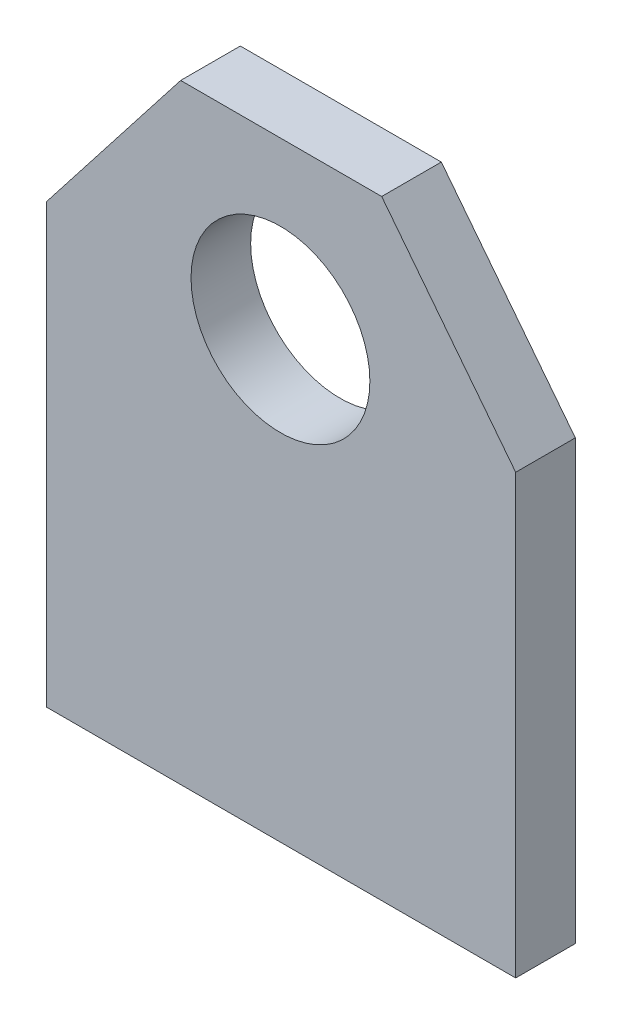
from build123d import *

# Parameters (mm, degrees)
LINEAR_AUSTRAGEN1_DEPTH = 8.382
SKIZZE2_R               = 12.570510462
LINEAR_AUSTRAGEN2_DEPTH = 109.468847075


with BuildPart() as part:
    # Skizze1 → Linear austragen1 (new body)
    with BuildSketch(Plane.XY):
        Polygon((0, 0), (-65.929053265, 0), (-65.929053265, 61.567334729), (-47.092023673, 85.723933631), (-18.837029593, 85.723933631), (0, 61.567334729), align=None)
    extrude(amount=LINEAR_AUSTRAGEN1_DEPTH)

    # Skizze2 → Linear austragen2 (cut, through all)
    with BuildSketch(Plane.XY.offset(8.382)):
        with Locations((-33.069092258, 62.41573868)):
            Circle(SKIZZE2_R)
    extrude(amount=-LINEAR_AUSTRAGEN2_DEPTH, mode=Mode.SUBTRACT)


solid = part.part
